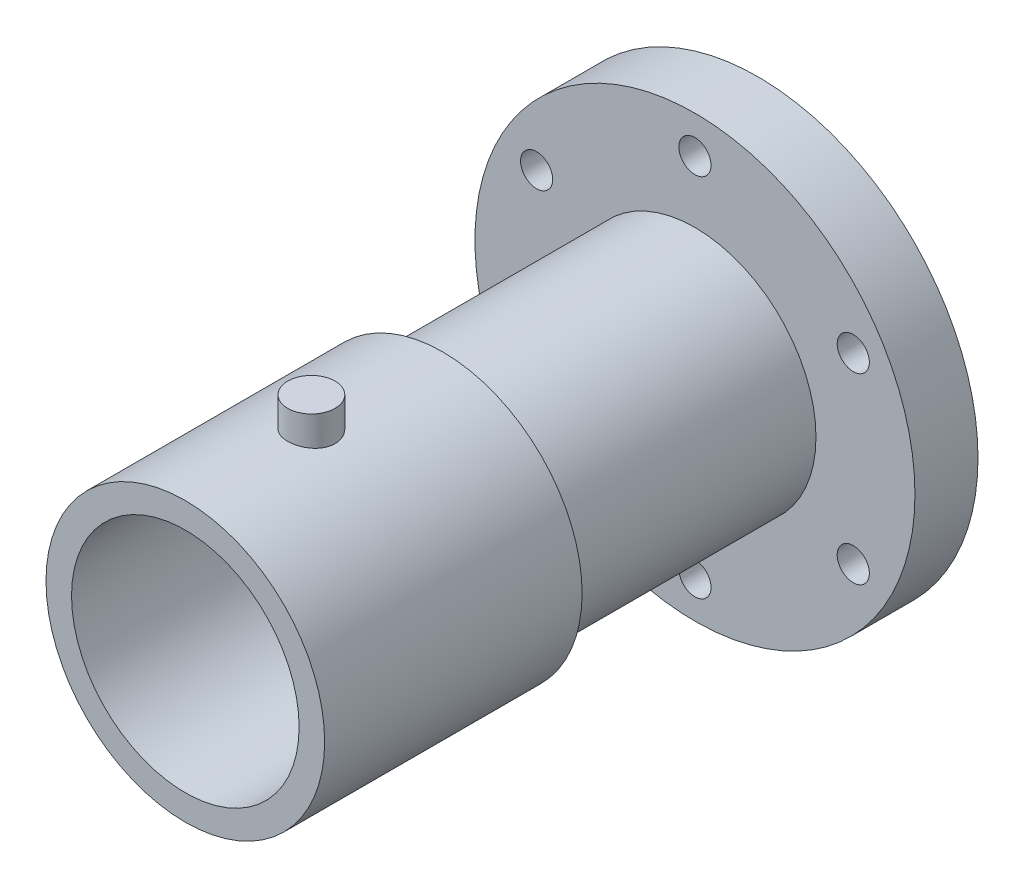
ISO-10303-21;
HEADER;
FILE_DESCRIPTION(('STEP AP214'),'2;1');
FILE_NAME('part.step','',(''),(''),'','','');
FILE_SCHEMA(('AUTOMOTIVE_DESIGN { 1 0 10303 214 1 1 1 1 }'));
ENDSEC;
DATA;
#1=APPLICATION_CONTEXT('core data for automotive mechanical design processes');
#2=APPLICATION_PROTOCOL_DEFINITION('international standard','automotive_design',2000,#1);
#3=PRODUCT_CONTEXT('',#1,'mechanical');
#4=PRODUCT('Part','Part','',(#3));
#5=PRODUCT_RELATED_PRODUCT_CATEGORY('part','',(#4));
#6=PRODUCT_DEFINITION_FORMATION('','',#4);
#7=PRODUCT_DEFINITION_CONTEXT('part definition',#1,'design');
#8=PRODUCT_DEFINITION('design','',#6,#7);
#9=PRODUCT_DEFINITION_SHAPE('','',#8);
#10=(LENGTH_UNIT() NAMED_UNIT(*) SI_UNIT(.MILLI.,.METRE.));
#11=(NAMED_UNIT(*) PLANE_ANGLE_UNIT() SI_UNIT($,.RADIAN.));
#12=(NAMED_UNIT(*) SI_UNIT($,.STERADIAN.) SOLID_ANGLE_UNIT());
#13=UNCERTAINTY_MEASURE_WITH_UNIT(LENGTH_MEASURE(1.E-05),#10,'distance_accuracy_value','');
#14=(GEOMETRIC_REPRESENTATION_CONTEXT(3) GLOBAL_UNCERTAINTY_ASSIGNED_CONTEXT((#13)) GLOBAL_UNIT_ASSIGNED_CONTEXT((#10,
#11,#12)) REPRESENTATION_CONTEXT('',''));
#15=CARTESIAN_POINT('',(0.,0.,0.));
#16=DIRECTION('',(0.,0.,1.));
#17=DIRECTION('',(1.,0.,0.));
#18=AXIS2_PLACEMENT_3D('',#15,#16,#17);
#19=CARTESIAN_POINT('',(0.,0.,12.7));
#20=DIRECTION('',(0.,0.,1.));
#21=DIRECTION('',(1.,0.,0.));
#22=AXIS2_PLACEMENT_3D('',#19,#20,#21);
#23=PLANE('',#22);
#24=CARTESIAN_POINT('',(-31.8957156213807,18.4150000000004,12.7));
#25=DIRECTION('',(0.,0.,1.));
#26=DIRECTION('',(0.50000000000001,0.866025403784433,0.));
#27=AXIS2_PLACEMENT_3D('',#24,#25,#26);
#28=CIRCLE('',#27,3.2385);
#29=CARTESIAN_POINT('',(-30.2764656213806,21.2196232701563,12.7));
#30=VERTEX_POINT('',#29);
#31=EDGE_CURVE('E89',#30,#30,#28,.T.);
#32=ORIENTED_EDGE('',*,*,#31,.F.);
#33=EDGE_LOOP('',(#32));
#34=FACE_BOUND('',#33,.T.);
#35=CARTESIAN_POINT('',(-31.895715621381,-18.4149999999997,12.7));
#36=DIRECTION('',(0.,0.,1.));
#37=DIRECTION('',(-0.499999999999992,0.866025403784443,0.));
#38=AXIS2_PLACEMENT_3D('',#35,#36,#37);
#39=CIRCLE('',#38,3.2385);
#40=CARTESIAN_POINT('',(-33.514965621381,-15.6103767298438,12.7));
#41=VERTEX_POINT('',#40);
#42=EDGE_CURVE('E83',#41,#41,#39,.T.);
#43=ORIENTED_EDGE('',*,*,#42,.F.);
#44=EDGE_LOOP('',(#43));
#45=FACE_BOUND('',#44,.T.);
#46=CARTESIAN_POINT('',(-2.57182664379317E-13,-36.83,12.7));
#47=DIRECTION('',(0.,0.,1.));
#48=DIRECTION('',(-1.,0.,0.));
#49=AXIS2_PLACEMENT_3D('',#46,#47,#48);
#50=CIRCLE('',#49,3.2385);
#51=CARTESIAN_POINT('',(-3.23850000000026,-36.83,12.7));
#52=VERTEX_POINT('',#51);
#53=EDGE_CURVE('E77',#52,#52,#50,.T.);
#54=ORIENTED_EDGE('',*,*,#53,.F.);
#55=EDGE_LOOP('',(#54));
#56=FACE_BOUND('',#55,.T.);
#57=CARTESIAN_POINT('',(31.8957156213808,-18.4150000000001,12.7));
#58=DIRECTION('',(0.,0.,1.));
#59=DIRECTION('',(-0.500000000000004,-0.866025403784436,0.));
#60=AXIS2_PLACEMENT_3D('',#57,#58,#59);
#61=CIRCLE('',#60,3.2385);
#62=CARTESIAN_POINT('',(30.2764656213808,-21.219623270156,12.7));
#63=VERTEX_POINT('',#62);
#64=EDGE_CURVE('E71',#63,#63,#61,.T.);
#65=ORIENTED_EDGE('',*,*,#64,.F.);
#66=EDGE_LOOP('',(#65));
#67=FACE_BOUND('',#66,.T.);
#68=CARTESIAN_POINT('',(31.8957156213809,18.4149999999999,12.7));
#69=DIRECTION('',(0.,0.,1.));
#70=DIRECTION('',(0.499999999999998,-0.86602540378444,0.));
#71=AXIS2_PLACEMENT_3D('',#68,#69,#70);
#72=CIRCLE('',#71,3.2385);
#73=CARTESIAN_POINT('',(33.5149656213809,15.610376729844,12.7));
#74=VERTEX_POINT('',#73);
#75=EDGE_CURVE('E65',#74,#74,#72,.T.);
#76=ORIENTED_EDGE('',*,*,#75,.F.);
#77=EDGE_LOOP('',(#76));
#78=FACE_BOUND('',#77,.T.);
#79=CARTESIAN_POINT('',(0.,36.83,12.7));
#80=DIRECTION('',(0.,0.,1.));
#81=DIRECTION('',(1.,0.,0.));
#82=AXIS2_PLACEMENT_3D('',#79,#80,#81);
#83=CIRCLE('',#82,3.2385);
#84=CARTESIAN_POINT('',(3.2385,36.83,12.7));
#85=VERTEX_POINT('',#84);
#86=EDGE_CURVE('E59',#85,#85,#83,.T.);
#87=ORIENTED_EDGE('',*,*,#86,.F.);
#88=EDGE_LOOP('',(#87));
#89=FACE_BOUND('',#88,.T.);
#90=CARTESIAN_POINT('',(0.,0.,12.7));
#91=DIRECTION('',(0.,0.,1.));
#92=DIRECTION('',(1.,0.,0.));
#93=AXIS2_PLACEMENT_3D('',#90,#91,#92);
#94=CIRCLE('',#93,44.323);
#95=CARTESIAN_POINT('',(44.323,0.,12.7));
#96=VERTEX_POINT('',#95);
#97=EDGE_CURVE('E10',#96,#96,#94,.T.);
#98=ORIENTED_EDGE('',*,*,#97,.T.);
#99=EDGE_LOOP('',(#98));
#100=FACE_BOUND('',#99,.T.);
#101=CARTESIAN_POINT('',(0.,0.,12.7));
#102=DIRECTION('',(0.,0.,1.));
#103=DIRECTION('',(1.,0.,0.));
#104=AXIS2_PLACEMENT_3D('',#101,#102,#103);
#105=CIRCLE('',#104,24.384);
#106=CARTESIAN_POINT('',(24.384,0.,12.7));
#107=VERTEX_POINT('',#106);
#108=EDGE_CURVE('E39',#107,#107,#105,.T.);
#109=ORIENTED_EDGE('',*,*,#108,.F.);
#110=EDGE_LOOP('',(#109));
#111=FACE_BOUND('',#110,.T.);
#112=ADVANCED_FACE('F24',(#34,#45,#56,#67,#78,#89,#100,#111),#23,.T.);
#113=CARTESIAN_POINT('',(0.,0.,12.7));
#114=DIRECTION('',(0.,0.,-1.));
#115=DIRECTION('',(-1.,0.,0.));
#116=AXIS2_PLACEMENT_3D('',#113,#114,#115);
#117=CYLINDRICAL_SURFACE('',#116,44.323);
#118=ORIENTED_EDGE('',*,*,#97,.F.);
#119=EDGE_LOOP('',(#118));
#120=FACE_BOUND('',#119,.T.);
#121=CARTESIAN_POINT('',(0.,0.,0.));
#122=DIRECTION('',(0.,0.,1.));
#123=DIRECTION('',(1.,0.,0.));
#124=AXIS2_PLACEMENT_3D('',#121,#122,#123);
#125=CIRCLE('',#124,44.323);
#126=CARTESIAN_POINT('',(44.323,0.,0.));
#127=VERTEX_POINT('',#126);
#128=EDGE_CURVE('E31',#127,#127,#125,.T.);
#129=ORIENTED_EDGE('',*,*,#128,.T.);
#130=EDGE_LOOP('',(#129));
#131=FACE_BOUND('',#130,.T.);
#132=ADVANCED_FACE('F26',(#120,#131),#117,.T.);
#133=CARTESIAN_POINT('',(0.,0.,0.));
#134=DIRECTION('',(0.,0.,1.));
#135=DIRECTION('',(1.,0.,0.));
#136=AXIS2_PLACEMENT_3D('',#133,#134,#135);
#137=PLANE('',#136);
#138=CARTESIAN_POINT('',(-31.8957156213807,18.4150000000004,0.));
#139=DIRECTION('',(0.,0.,1.));
#140=DIRECTION('',(0.50000000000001,0.866025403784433,0.));
#141=AXIS2_PLACEMENT_3D('',#138,#139,#140);
#142=CIRCLE('',#141,3.2385);
#143=CARTESIAN_POINT('',(-30.2764656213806,21.2196232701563,0.));
#144=VERTEX_POINT('',#143);
#145=EDGE_CURVE('E86',#144,#144,#142,.T.);
#146=ORIENTED_EDGE('',*,*,#145,.T.);
#147=EDGE_LOOP('',(#146));
#148=FACE_BOUND('',#147,.T.);
#149=CARTESIAN_POINT('',(-31.895715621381,-18.4149999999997,0.));
#150=DIRECTION('',(0.,0.,1.));
#151=DIRECTION('',(-0.499999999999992,0.866025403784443,0.));
#152=AXIS2_PLACEMENT_3D('',#149,#150,#151);
#153=CIRCLE('',#152,3.2385);
#154=CARTESIAN_POINT('',(-33.514965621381,-15.6103767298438,0.));
#155=VERTEX_POINT('',#154);
#156=EDGE_CURVE('E80',#155,#155,#153,.T.);
#157=ORIENTED_EDGE('',*,*,#156,.T.);
#158=EDGE_LOOP('',(#157));
#159=FACE_BOUND('',#158,.T.);
#160=CARTESIAN_POINT('',(-2.57182664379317E-13,-36.83,0.));
#161=DIRECTION('',(0.,0.,1.));
#162=DIRECTION('',(-1.,0.,0.));
#163=AXIS2_PLACEMENT_3D('',#160,#161,#162);
#164=CIRCLE('',#163,3.2385);
#165=CARTESIAN_POINT('',(-3.23850000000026,-36.83,0.));
#166=VERTEX_POINT('',#165);
#167=EDGE_CURVE('E74',#166,#166,#164,.T.);
#168=ORIENTED_EDGE('',*,*,#167,.T.);
#169=EDGE_LOOP('',(#168));
#170=FACE_BOUND('',#169,.T.);
#171=CARTESIAN_POINT('',(31.8957156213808,-18.4150000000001,0.));
#172=DIRECTION('',(0.,0.,1.));
#173=DIRECTION('',(-0.500000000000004,-0.866025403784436,0.));
#174=AXIS2_PLACEMENT_3D('',#171,#172,#173);
#175=CIRCLE('',#174,3.2385);
#176=CARTESIAN_POINT('',(30.2764656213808,-21.219623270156,0.));
#177=VERTEX_POINT('',#176);
#178=EDGE_CURVE('E68',#177,#177,#175,.T.);
#179=ORIENTED_EDGE('',*,*,#178,.T.);
#180=EDGE_LOOP('',(#179));
#181=FACE_BOUND('',#180,.T.);
#182=CARTESIAN_POINT('',(31.8957156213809,18.4149999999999,0.));
#183=DIRECTION('',(0.,0.,1.));
#184=DIRECTION('',(0.499999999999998,-0.86602540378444,0.));
#185=AXIS2_PLACEMENT_3D('',#182,#183,#184);
#186=CIRCLE('',#185,3.2385);
#187=CARTESIAN_POINT('',(33.5149656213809,15.610376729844,0.));
#188=VERTEX_POINT('',#187);
#189=EDGE_CURVE('E62',#188,#188,#186,.T.);
#190=ORIENTED_EDGE('',*,*,#189,.T.);
#191=EDGE_LOOP('',(#190));
#192=FACE_BOUND('',#191,.T.);
#193=CARTESIAN_POINT('',(0.,36.83,0.));
#194=DIRECTION('',(0.,0.,1.));
#195=DIRECTION('',(1.,0.,0.));
#196=AXIS2_PLACEMENT_3D('',#193,#194,#195);
#197=CIRCLE('',#196,3.2385);
#198=CARTESIAN_POINT('',(3.2385,36.83,0.));
#199=VERTEX_POINT('',#198);
#200=EDGE_CURVE('E56',#199,#199,#197,.T.);
#201=ORIENTED_EDGE('',*,*,#200,.T.);
#202=EDGE_LOOP('',(#201));
#203=FACE_BOUND('',#202,.T.);
#204=ORIENTED_EDGE('',*,*,#128,.F.);
#205=EDGE_LOOP('',(#204));
#206=FACE_BOUND('',#205,.T.);
#207=ADVANCED_FACE('F121',(#148,#159,#170,#181,#192,#203,#206),#137,.F.);
#208=CARTESIAN_POINT('',(0.,0.,63.5));
#209=DIRECTION('',(0.,0.,-1.));
#210=DIRECTION('',(-1.,0.,0.));
#211=AXIS2_PLACEMENT_3D('',#208,#209,#210);
#212=CYLINDRICAL_SURFACE('',#211,24.384);
#213=CARTESIAN_POINT('',(0.,0.,63.5));
#214=DIRECTION('',(0.,0.,1.));
#215=DIRECTION('',(1.,0.,0.));
#216=AXIS2_PLACEMENT_3D('',#213,#214,#215);
#217=CIRCLE('',#216,24.384);
#218=CARTESIAN_POINT('',(24.384,0.,63.5));
#219=VERTEX_POINT('',#218);
#220=EDGE_CURVE('E35',#219,#219,#217,.T.);
#221=ORIENTED_EDGE('',*,*,#220,.F.);
#222=EDGE_LOOP('',(#221));
#223=FACE_BOUND('',#222,.T.);
#224=ORIENTED_EDGE('',*,*,#108,.T.);
#225=EDGE_LOOP('',(#224));
#226=FACE_BOUND('',#225,.T.);
#227=ADVANCED_FACE('F127',(#223,#226),#212,.T.);
#228=CARTESIAN_POINT('',(0.,0.,63.5));
#229=DIRECTION('',(0.,0.,1.));
#230=DIRECTION('',(1.,0.,0.));
#231=AXIS2_PLACEMENT_3D('',#228,#229,#230);
#232=PLANE('',#231);
#233=CARTESIAN_POINT('',(0.,0.,63.5));
#234=DIRECTION('',(0.,0.,1.));
#235=DIRECTION('',(1.,0.,0.));
#236=AXIS2_PLACEMENT_3D('',#233,#234,#235);
#237=CIRCLE('',#236,28.067);
#238=CARTESIAN_POINT('',(28.067,0.,63.5));
#239=VERTEX_POINT('',#238);
#240=EDGE_CURVE('E47',#239,#239,#237,.T.);
#241=ORIENTED_EDGE('',*,*,#240,.F.);
#242=EDGE_LOOP('',(#241));
#243=FACE_BOUND('',#242,.T.);
#244=ORIENTED_EDGE('',*,*,#220,.T.);
#245=EDGE_LOOP('',(#244));
#246=FACE_BOUND('',#245,.T.);
#247=ADVANCED_FACE('F131',(#243,#246),#232,.F.);
#248=CARTESIAN_POINT('',(0.,0.,115.3668));
#249=DIRECTION('',(0.,0.,-1.));
#250=DIRECTION('',(-1.,0.,0.));
#251=AXIS2_PLACEMENT_3D('',#248,#249,#250);
#252=CYLINDRICAL_SURFACE('',#251,28.067);
#253=CARTESIAN_POINT('',(0.,28.067,94.7293));
#254=CARTESIAN_POINT('',(0.265468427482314,28.0669954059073,94.7292894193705));
#255=CARTESIAN_POINT('',(0.531079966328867,28.0631944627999,94.7070286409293));
#256=CARTESIAN_POINT('',(1.05484861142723,28.0483978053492,94.6186135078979));
#257=CARTESIAN_POINT('',(1.31299871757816,28.0373955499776,94.5524192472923));
#258=CARTESIAN_POINT('',(1.81419127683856,28.0094298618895,94.378197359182));
#259=CARTESIAN_POINT('',(2.05724607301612,27.9924713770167,94.2702044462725));
#260=CARTESIAN_POINT('',(2.52175623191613,27.9544560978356,94.0155427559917));
#261=CARTESIAN_POINT('',(2.74321396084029,27.9333997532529,93.8688782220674));
#262=CARTESIAN_POINT('',(3.16046456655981,27.8892886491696,93.5394933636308));
#263=CARTESIAN_POINT('',(3.35601276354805,27.866217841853,93.3564652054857));
#264=CARTESIAN_POINT('',(3.7137794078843,27.8208003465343,92.9602111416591));
#265=CARTESIAN_POINT('',(3.87599571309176,27.7984537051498,92.7469832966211));
#266=CARTESIAN_POINT('',(4.16347957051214,27.7568592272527,92.2946951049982));
#267=CARTESIAN_POINT('',(4.28850420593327,27.7376321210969,92.0554782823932));
#268=CARTESIAN_POINT('',(4.49650209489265,27.7046768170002,91.5590576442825));
#269=CARTESIAN_POINT('',(4.57947829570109,27.6909482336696,91.3018550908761));
#270=CARTESIAN_POINT('',(4.70025101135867,27.6707043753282,90.7793611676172));
#271=CARTESIAN_POINT('',(4.73847055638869,27.664121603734,90.5141702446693));
#272=CARTESIAN_POINT('',(4.76995685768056,27.6587106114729,89.9810640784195));
#273=CARTESIAN_POINT('',(4.76322691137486,27.6598818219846,89.7131490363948));
#274=CARTESIAN_POINT('',(4.70534962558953,27.6697848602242,89.1852257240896));
#275=CARTESIAN_POINT('',(4.65467829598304,27.6784356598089,88.9251635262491));
#276=CARTESIAN_POINT('',(4.51110400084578,27.7021962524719,88.4172861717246));
#277=CARTESIAN_POINT('',(4.41819953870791,27.7173062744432,88.169471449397));
#278=CARTESIAN_POINT('',(4.1923159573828,27.7523699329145,87.6917030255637));
#279=CARTESIAN_POINT('',(4.05913992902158,27.7723472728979,87.4618442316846));
#280=CARTESIAN_POINT('',(3.75663332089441,27.8148782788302,87.0275557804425));
#281=CARTESIAN_POINT('',(3.58729971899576,27.8374321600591,86.8231282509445));
#282=CARTESIAN_POINT('',(3.21469491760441,27.8829306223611,86.4427505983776));
#283=CARTESIAN_POINT('',(3.01101547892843,27.9058764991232,86.2672002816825));
#284=CARTESIAN_POINT('',(2.57687937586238,27.9493057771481,85.9527069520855));
#285=CARTESIAN_POINT('',(2.34642252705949,27.9697891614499,85.8137641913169));
#286=CARTESIAN_POINT('',(1.86489184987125,28.0060162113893,85.5763905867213));
#287=CARTESIAN_POINT('',(1.61379984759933,28.0217556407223,85.4779959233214));
#288=CARTESIAN_POINT('',(1.09832729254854,28.0466875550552,85.3248871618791));
#289=CARTESIAN_POINT('',(0.833947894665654,28.0558806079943,85.2701692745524));
#290=CARTESIAN_POINT('',(0.302850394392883,28.0666073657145,85.2065112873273));
#291=CARTESIAN_POINT('',(0.0361998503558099,28.0682328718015,85.1970224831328));
#292=CARTESIAN_POINT('',(-0.494880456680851,28.0638931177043,85.2226279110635));
#293=CARTESIAN_POINT('',(-0.759310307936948,28.0579281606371,85.2577203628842));
#294=CARTESIAN_POINT('',(-1.27674190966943,28.0391345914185,85.3710357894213));
#295=CARTESIAN_POINT('',(-1.52980504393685,28.0263493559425,85.4489862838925));
#296=CARTESIAN_POINT('',(-2.019271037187,27.9953430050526,85.6455139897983));
#297=CARTESIAN_POINT('',(-2.25567293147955,27.9771215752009,85.7640935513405));
#298=CARTESIAN_POINT('',(-2.7074835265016,27.9370361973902,86.0397642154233));
#299=CARTESIAN_POINT('',(-2.9226808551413,27.9151405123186,86.1971970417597));
#300=CARTESIAN_POINT('',(-3.3237981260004,27.8702290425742,86.5456362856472));
#301=CARTESIAN_POINT('',(-3.50971585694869,27.847213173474,86.7366452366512));
#302=CARTESIAN_POINT('',(-3.84903742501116,27.8023574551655,87.149278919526));
#303=CARTESIAN_POINT('',(-4.00207000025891,27.7805329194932,87.3712108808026));
#304=CARTESIAN_POINT('',(-4.26868195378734,27.7408198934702,87.8379540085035));
#305=CARTESIAN_POINT('',(-4.38226261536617,27.7229312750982,88.0827644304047));
#306=CARTESIAN_POINT('',(-4.56619528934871,27.6932311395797,88.5872903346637));
#307=CARTESIAN_POINT('',(-4.63673007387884,27.6813939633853,88.8469376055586));
#308=CARTESIAN_POINT('',(-4.73314247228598,27.6650733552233,89.3746129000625));
#309=CARTESIAN_POINT('',(-4.75902412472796,27.6605892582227,89.642640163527));
#310=CARTESIAN_POINT('',(-4.7652798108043,27.6595118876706,90.1757583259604));
#311=CARTESIAN_POINT('',(-4.74623838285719,27.6628172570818,90.4408423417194));
#312=CARTESIAN_POINT('',(-4.66445456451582,27.6767238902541,90.9639759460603));
#313=CARTESIAN_POINT('',(-4.6017123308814,27.6873251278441,91.2220255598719));
#314=CARTESIAN_POINT('',(-4.4345350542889,27.7145899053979,91.7235270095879));
#315=CARTESIAN_POINT('',(-4.33015213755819,27.7312458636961,91.9669966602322));
#316=CARTESIAN_POINT('',(-4.08271707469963,27.7687504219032,92.433062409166));
#317=CARTESIAN_POINT('',(-3.93966289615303,27.7895992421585,92.6556574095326));
#318=CARTESIAN_POINT('',(-3.61686733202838,27.8334608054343,93.0766050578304));
#319=CARTESIAN_POINT('',(-3.43669652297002,27.8564970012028,93.2746260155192));
#320=CARTESIAN_POINT('',(-3.04568638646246,27.9019522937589,93.6378232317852));
#321=CARTESIAN_POINT('',(-2.83483999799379,27.9243712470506,93.8029919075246));
#322=CARTESIAN_POINT('',(-2.386660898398,27.9662530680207,94.0968843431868));
#323=CARTESIAN_POINT('',(-2.14914876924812,27.9856935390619,94.2253377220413));
#324=CARTESIAN_POINT('',(-1.65568130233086,28.0192100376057,94.4403235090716));
#325=CARTESIAN_POINT('',(-1.39974447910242,28.0332913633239,94.5268973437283));
#326=CARTESIAN_POINT('',(-0.952370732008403,28.051457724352,94.6370413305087));
#327=CARTESIAN_POINT('',(-0.763628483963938,28.0572546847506,94.6715824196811));
#328=CARTESIAN_POINT('',(-0.38328232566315,28.065027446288,94.7177153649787));
#329=CARTESIAN_POINT('',(-0.191678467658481,28.0670033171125,94.7293076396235));
#330=CARTESIAN_POINT('',(0.,28.067,94.7293));
#331=B_SPLINE_CURVE_WITH_KNOTS('',3,(#253,#254,#255,#256,#257,#258,#259,#260,#261,#262,#263,
#264,#265,#266,#267,#268,#269,#270,#271,#272,#273,#274,#275,#276,#277,#278,#279,#280,#281,#282,
#283,#284,#285,#286,#287,#288,#289,#290,#291,#292,#293,#294,#295,#296,#297,#298,#299,#300,#301,
#302,#303,#304,#305,#306,#307,#308,#309,#310,#311,#312,#313,#314,#315,#316,#317,#318,#319,#320,
#321,#322,#323,#324,#325,#326,#327,#328,#329,#330),.UNSPECIFIED.,.T.,.F.,(4,2,2,2,2,2,2,2,2,2,2,
2,2,2,2,2,2,2,2,2,2,2,2,2,2,2,2,2,2,2,2,2,2,2,2,2,2,2,4),(0.,0.795704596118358,1.59213294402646,
2.38790125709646,3.18358228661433,3.98631049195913,4.78909027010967,5.59700373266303,
6.40486055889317,7.20501844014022,8.00511762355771,8.79665622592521,9.58822288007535,
10.3837242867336,11.1792922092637,11.9850859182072,12.790885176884,13.5974018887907,
14.4038486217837,15.2004864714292,15.9970925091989,16.7886915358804,17.5803363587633,
18.3792088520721,19.1781416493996,19.9856684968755,20.7931690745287,21.5972167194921,
22.4011916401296,23.194763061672,23.9883316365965,24.7809099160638,25.5735298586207,
26.3758945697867,27.1784442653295,27.9867602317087,28.794274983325,29.3688149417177,
29.9433444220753),.UNSPECIFIED.);
#332=CARTESIAN_POINT('',(0.,28.067,94.7293));
#333=VERTEX_POINT('',#332);
#334=EDGE_CURVE('E92',#333,#333,#331,.T.);
#335=ORIENTED_EDGE('',*,*,#334,.F.);
#336=EDGE_LOOP('',(#335));
#337=FACE_BOUND('',#336,.T.);
#338=CARTESIAN_POINT('',(0.,0.,115.3668));
#339=DIRECTION('',(0.,0.,1.));
#340=DIRECTION('',(1.,0.,0.));
#341=AXIS2_PLACEMENT_3D('',#338,#339,#340);
#342=CIRCLE('',#341,28.067);
#343=CARTESIAN_POINT('',(28.067,0.,115.3668));
#344=VERTEX_POINT('',#343);
#345=EDGE_CURVE('E44',#344,#344,#342,.T.);
#346=ORIENTED_EDGE('',*,*,#345,.F.);
#347=EDGE_LOOP('',(#346));
#348=FACE_BOUND('',#347,.T.);
#349=ORIENTED_EDGE('',*,*,#240,.T.);
#350=EDGE_LOOP('',(#349));
#351=FACE_BOUND('',#350,.T.);
#352=ADVANCED_FACE('F133',(#337,#348,#351),#252,.T.);
#353=CARTESIAN_POINT('',(0.,0.,115.3668));
#354=DIRECTION('',(0.,0.,1.));
#355=DIRECTION('',(1.,0.,0.));
#356=AXIS2_PLACEMENT_3D('',#353,#354,#355);
#357=PLANE('',#356);
#358=CARTESIAN_POINT('',(0.,0.,115.3668));
#359=DIRECTION('',(0.,0.,1.));
#360=DIRECTION('',(1.,0.,0.));
#361=AXIS2_PLACEMENT_3D('',#358,#359,#360);
#362=CIRCLE('',#361,22.9235);
#363=CARTESIAN_POINT('',(22.9235,0.,115.3668));
#364=VERTEX_POINT('',#363);
#365=EDGE_CURVE('E53',#364,#364,#362,.T.);
#366=ORIENTED_EDGE('',*,*,#365,.F.);
#367=EDGE_LOOP('',(#366));
#368=FACE_BOUND('',#367,.T.);
#369=ORIENTED_EDGE('',*,*,#345,.T.);
#370=EDGE_LOOP('',(#369));
#371=FACE_BOUND('',#370,.T.);
#372=ADVANCED_FACE('F136',(#368,#371),#357,.T.);
#373=CARTESIAN_POINT('',(0.,0.,70.9168));
#374=DIRECTION('',(0.,0.,1.));
#375=DIRECTION('',(1.,0.,0.));
#376=AXIS2_PLACEMENT_3D('',#373,#374,#375);
#377=CYLINDRICAL_SURFACE('',#376,22.9235);
#378=CARTESIAN_POINT('',(0.,0.,70.9168));
#379=DIRECTION('',(0.,0.,1.));
#380=DIRECTION('',(1.,0.,0.));
#381=AXIS2_PLACEMENT_3D('',#378,#379,#380);
#382=CIRCLE('',#381,22.9235);
#383=CARTESIAN_POINT('',(22.9235,0.,70.9168));
#384=VERTEX_POINT('',#383);
#385=EDGE_CURVE('E50',#384,#384,#382,.T.);
#386=ORIENTED_EDGE('',*,*,#385,.F.);
#387=EDGE_LOOP('',(#386));
#388=FACE_BOUND('',#387,.T.);
#389=ORIENTED_EDGE('',*,*,#365,.T.);
#390=EDGE_LOOP('',(#389));
#391=FACE_BOUND('',#390,.T.);
#392=ADVANCED_FACE('F140',(#388,#391),#377,.F.);
#393=CARTESIAN_POINT('',(0.,0.,70.9168));
#394=DIRECTION('',(0.,0.,1.));
#395=DIRECTION('',(1.,0.,0.));
#396=AXIS2_PLACEMENT_3D('',#393,#394,#395);
#397=PLANE('',#396);
#398=ORIENTED_EDGE('',*,*,#385,.T.);
#399=EDGE_LOOP('',(#398));
#400=FACE_BOUND('',#399,.T.);
#401=ADVANCED_FACE('F147',(#400),#397,.T.);
#402=CARTESIAN_POINT('',(0.,36.83,0.));
#403=DIRECTION('',(0.,0.,1.));
#404=DIRECTION('',(1.,0.,0.));
#405=AXIS2_PLACEMENT_3D('',#402,#403,#404);
#406=CYLINDRICAL_SURFACE('',#405,3.2385);
#407=ORIENTED_EDGE('',*,*,#200,.F.);
#408=EDGE_LOOP('',(#407));
#409=FACE_BOUND('',#408,.T.);
#410=ORIENTED_EDGE('',*,*,#86,.T.);
#411=EDGE_LOOP('',(#410));
#412=FACE_BOUND('',#411,.T.);
#413=ADVANCED_FACE('F151',(#409,#412),#406,.F.);
#414=CARTESIAN_POINT('',(31.8957156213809,18.4149999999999,0.));
#415=DIRECTION('',(0.,0.,1.));
#416=DIRECTION('',(1.,0.,0.));
#417=AXIS2_PLACEMENT_3D('',#414,#415,#416);
#418=CYLINDRICAL_SURFACE('',#417,3.2385);
#419=ORIENTED_EDGE('',*,*,#189,.F.);
#420=EDGE_LOOP('',(#419));
#421=FACE_BOUND('',#420,.T.);
#422=ORIENTED_EDGE('',*,*,#75,.T.);
#423=EDGE_LOOP('',(#422));
#424=FACE_BOUND('',#423,.T.);
#425=ADVANCED_FACE('F154',(#421,#424),#418,.F.);
#426=CARTESIAN_POINT('',(31.8957156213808,-18.4150000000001,0.));
#427=DIRECTION('',(0.,0.,1.));
#428=DIRECTION('',(1.,0.,0.));
#429=AXIS2_PLACEMENT_3D('',#426,#427,#428);
#430=CYLINDRICAL_SURFACE('',#429,3.2385);
#431=ORIENTED_EDGE('',*,*,#178,.F.);
#432=EDGE_LOOP('',(#431));
#433=FACE_BOUND('',#432,.T.);
#434=ORIENTED_EDGE('',*,*,#64,.T.);
#435=EDGE_LOOP('',(#434));
#436=FACE_BOUND('',#435,.T.);
#437=ADVANCED_FACE('F158',(#433,#436),#430,.F.);
#438=CARTESIAN_POINT('',(-2.57182664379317E-13,-36.83,0.));
#439=DIRECTION('',(0.,0.,1.));
#440=DIRECTION('',(1.,0.,0.));
#441=AXIS2_PLACEMENT_3D('',#438,#439,#440);
#442=CYLINDRICAL_SURFACE('',#441,3.2385);
#443=ORIENTED_EDGE('',*,*,#167,.F.);
#444=EDGE_LOOP('',(#443));
#445=FACE_BOUND('',#444,.T.);
#446=ORIENTED_EDGE('',*,*,#53,.T.);
#447=EDGE_LOOP('',(#446));
#448=FACE_BOUND('',#447,.T.);
#449=ADVANCED_FACE('F162',(#445,#448),#442,.F.);
#450=CARTESIAN_POINT('',(-31.895715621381,-18.4149999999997,0.));
#451=DIRECTION('',(0.,0.,1.));
#452=DIRECTION('',(1.,0.,0.));
#453=AXIS2_PLACEMENT_3D('',#450,#451,#452);
#454=CYLINDRICAL_SURFACE('',#453,3.2385);
#455=ORIENTED_EDGE('',*,*,#156,.F.);
#456=EDGE_LOOP('',(#455));
#457=FACE_BOUND('',#456,.T.);
#458=ORIENTED_EDGE('',*,*,#42,.T.);
#459=EDGE_LOOP('',(#458));
#460=FACE_BOUND('',#459,.T.);
#461=ADVANCED_FACE('F166',(#457,#460),#454,.F.);
#462=CARTESIAN_POINT('',(-31.8957156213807,18.4150000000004,0.));
#463=DIRECTION('',(0.,0.,1.));
#464=DIRECTION('',(1.,0.,0.));
#465=AXIS2_PLACEMENT_3D('',#462,#463,#464);
#466=CYLINDRICAL_SURFACE('',#465,3.2385);
#467=ORIENTED_EDGE('',*,*,#145,.F.);
#468=EDGE_LOOP('',(#467));
#469=FACE_BOUND('',#468,.T.);
#470=ORIENTED_EDGE('',*,*,#31,.T.);
#471=EDGE_LOOP('',(#470));
#472=FACE_BOUND('',#471,.T.);
#473=ADVANCED_FACE('F111',(#469,#472),#466,.F.);
#474=CARTESIAN_POINT('',(0.,-44.324,89.9668));
#475=DIRECTION('',(0.,1.,0.));
#476=DIRECTION('',(0.,0.,1.));
#477=AXIS2_PLACEMENT_3D('',#474,#475,#476);
#478=CYLINDRICAL_SURFACE('',#477,4.76249999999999);
#479=ORIENTED_EDGE('',*,*,#334,.T.);
#480=EDGE_LOOP('',(#479));
#481=FACE_BOUND('',#480,.T.);
#482=CARTESIAN_POINT('',(0.,33.8328,89.9668));
#483=DIRECTION('',(0.,1.,0.));
#484=DIRECTION('',(0.,0.,1.));
#485=AXIS2_PLACEMENT_3D('',#482,#483,#484);
#486=CIRCLE('',#485,4.76249999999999);
#487=CARTESIAN_POINT('',(0.,33.8328,94.7293));
#488=VERTEX_POINT('',#487);
#489=EDGE_CURVE('E99',#488,#488,#486,.T.);
#490=ORIENTED_EDGE('',*,*,#489,.F.);
#491=EDGE_LOOP('',(#490));
#492=FACE_BOUND('',#491,.T.);
#493=ADVANCED_FACE('F100',(#481,#492),#478,.T.);
#494=CARTESIAN_POINT('',(0.,33.8328,89.9668));
#495=DIRECTION('',(0.,1.,0.));
#496=DIRECTION('',(0.,0.,1.));
#497=AXIS2_PLACEMENT_3D('',#494,#495,#496);
#498=PLANE('',#497);
#499=ORIENTED_EDGE('',*,*,#489,.T.);
#500=EDGE_LOOP('',(#499));
#501=FACE_BOUND('',#500,.T.);
#502=ADVANCED_FACE('F105',(#501),#498,.T.);
#503=CLOSED_SHELL('',(#112,#132,#207,#227,#247,#352,#372,#392,#401,#413,#425,#437,#449,#461,
#473,#493,#502));
#504=MANIFOLD_SOLID_BREP('B2',#503);
#505=ADVANCED_BREP_SHAPE_REPRESENTATION('',(#18,#504),#14);
#506=SHAPE_DEFINITION_REPRESENTATION(#9,#505);
ENDSEC;
END-ISO-10303-21;
